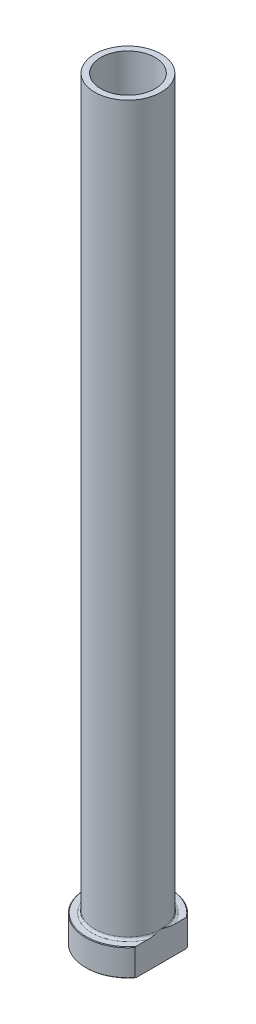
ISO-10303-21;
HEADER;
FILE_DESCRIPTION(('STEP AP214'),'2;1');
FILE_NAME('part.step','',(''),(''),'','','');
FILE_SCHEMA(('AUTOMOTIVE_DESIGN { 1 0 10303 214 1 1 1 1 }'));
ENDSEC;
DATA;
#1=APPLICATION_CONTEXT('core data for automotive mechanical design processes');
#2=APPLICATION_PROTOCOL_DEFINITION('international standard','automotive_design',2000,#1);
#3=PRODUCT_CONTEXT('',#1,'mechanical');
#4=PRODUCT('Part','Part','',(#3));
#5=PRODUCT_RELATED_PRODUCT_CATEGORY('part','',(#4));
#6=PRODUCT_DEFINITION_FORMATION('','',#4);
#7=PRODUCT_DEFINITION_CONTEXT('part definition',#1,'design');
#8=PRODUCT_DEFINITION('design','',#6,#7);
#9=PRODUCT_DEFINITION_SHAPE('','',#8);
#10=(LENGTH_UNIT() NAMED_UNIT(*) SI_UNIT(.MILLI.,.METRE.));
#11=(NAMED_UNIT(*) PLANE_ANGLE_UNIT() SI_UNIT($,.RADIAN.));
#12=(NAMED_UNIT(*) SI_UNIT($,.STERADIAN.) SOLID_ANGLE_UNIT());
#13=UNCERTAINTY_MEASURE_WITH_UNIT(LENGTH_MEASURE(1.E-05),#10,'distance_accuracy_value','');
#14=(GEOMETRIC_REPRESENTATION_CONTEXT(3) GLOBAL_UNCERTAINTY_ASSIGNED_CONTEXT((#13)) GLOBAL_UNIT_ASSIGNED_CONTEXT((#10,
#11,#12)) REPRESENTATION_CONTEXT('',''));
#15=CARTESIAN_POINT('',(0.,0.,0.));
#16=DIRECTION('',(0.,0.,1.));
#17=DIRECTION('',(1.,0.,0.));
#18=AXIS2_PLACEMENT_3D('',#15,#16,#17);
#19=CARTESIAN_POINT('',(0.,92.1876809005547,0.));
#20=DIRECTION('',(0.,1.,0.));
#21=DIRECTION('',(0.,0.,1.));
#22=AXIS2_PLACEMENT_3D('',#19,#20,#21);
#23=CYLINDRICAL_SURFACE('',#22,9.00000000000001);
#24=CARTESIAN_POINT('',(0.,250.,0.));
#25=DIRECTION('',(0.,1.,0.));
#26=DIRECTION('',(0.,0.,1.));
#27=AXIS2_PLACEMENT_3D('',#24,#25,#26);
#28=CIRCLE('',#27,9.00000000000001);
#29=CARTESIAN_POINT('',(0.,250.,9.00000000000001));
#30=VERTEX_POINT('',#29);
#31=EDGE_CURVE('E167',#30,#30,#28,.T.);
#32=ORIENTED_EDGE('',*,*,#31,.T.);
#33=EDGE_LOOP('',(#32));
#34=FACE_BOUND('',#33,.T.);
#35=CARTESIAN_POINT('',(0.,195.,0.));
#36=DIRECTION('',(0.,1.,0.));
#37=DIRECTION('',(0.,0.,1.));
#38=AXIS2_PLACEMENT_3D('',#35,#36,#37);
#39=CIRCLE('',#38,9.00000000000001);
#40=CARTESIAN_POINT('',(0.,195.,9.00000000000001));
#41=VERTEX_POINT('',#40);
#42=EDGE_CURVE('E170',#41,#41,#39,.T.);
#43=ORIENTED_EDGE('',*,*,#42,.F.);
#44=EDGE_LOOP('',(#43));
#45=FACE_BOUND('',#44,.T.);
#46=ADVANCED_FACE('F32',(#34,#45),#23,.F.);
#47=CARTESIAN_POINT('',(-9.00000000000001,250.,0.));
#48=DIRECTION('',(0.,1.,0.));
#49=DIRECTION('',(0.,0.,1.));
#50=AXIS2_PLACEMENT_3D('',#47,#48,#49);
#51=PLANE('',#50);
#52=CARTESIAN_POINT('',(0.,250.,0.));
#53=DIRECTION('',(0.,1.,0.));
#54=DIRECTION('',(0.,0.,1.));
#55=AXIS2_PLACEMENT_3D('',#52,#53,#54);
#56=CIRCLE('',#55,11.);
#57=CARTESIAN_POINT('',(0.,250.,11.));
#58=VERTEX_POINT('',#57);
#59=EDGE_CURVE('E174',#58,#58,#56,.T.);
#60=ORIENTED_EDGE('',*,*,#59,.T.);
#61=EDGE_LOOP('',(#60));
#62=FACE_BOUND('',#61,.T.);
#63=ORIENTED_EDGE('',*,*,#31,.F.);
#64=EDGE_LOOP('',(#63));
#65=FACE_BOUND('',#64,.T.);
#66=ADVANCED_FACE('F157',(#62,#65),#51,.T.);
#67=CARTESIAN_POINT('',(0.,92.1876809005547,0.));
#68=DIRECTION('',(0.,1.,0.));
#69=DIRECTION('',(0.,0.,1.));
#70=AXIS2_PLACEMENT_3D('',#67,#68,#69);
#71=CYLINDRICAL_SURFACE('',#70,11.);
#72=CARTESIAN_POINT('',(0.,9.8,0.));
#73=DIRECTION('',(0.,1.,0.));
#74=DIRECTION('',(0.,0.,1.));
#75=AXIS2_PLACEMENT_3D('',#72,#73,#74);
#76=CIRCLE('',#75,11.);
#77=CARTESIAN_POINT('',(11.,9.8,0.));
#78=VERTEX_POINT('',#77);
#79=EDGE_CURVE('E180',#78,#78,#76,.T.);
#80=ORIENTED_EDGE('',*,*,#79,.T.);
#81=EDGE_LOOP('',(#80));
#82=FACE_BOUND('',#81,.T.);
#83=ORIENTED_EDGE('',*,*,#59,.F.);
#84=EDGE_LOOP('',(#83));
#85=FACE_BOUND('',#84,.T.);
#86=ADVANCED_FACE('F162',(#82,#85),#71,.T.);
#87=CARTESIAN_POINT('',(-11.,9.,0.));
#88=DIRECTION('',(0.,1.,0.));
#89=DIRECTION('',(0.,0.,1.));
#90=AXIS2_PLACEMENT_3D('',#87,#88,#89);
#91=PLANE('',#90);
#92=DIRECTION('',(0.,0.,1.));
#93=VECTOR('',#92,1.);
#94=CARTESIAN_POINT('',(11.,9.,0.));
#95=LINE('',#94,#93);
#96=CARTESIAN_POINT('',(11.,9.,-8.33306666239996));
#97=VERTEX_POINT('',#96);
#98=CARTESIAN_POINT('',(11.,9.,-4.27083130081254));
#99=VERTEX_POINT('',#98);
#100=EDGE_CURVE('E54',#97,#99,#95,.T.);
#101=ORIENTED_EDGE('',*,*,#100,.F.);
#102=CARTESIAN_POINT('',(0.,9.,0.));
#103=DIRECTION('',(0.,1.,0.));
#104=DIRECTION('',(0.,0.,1.));
#105=AXIS2_PLACEMENT_3D('',#102,#103,#104);
#106=CIRCLE('',#105,13.8000000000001);
#107=CARTESIAN_POINT('',(11.,9.,8.33306666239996));
#108=VERTEX_POINT('',#107);
#109=EDGE_CURVE('E186',#97,#108,#106,.T.);
#110=ORIENTED_EDGE('',*,*,#109,.T.);
#111=CARTESIAN_POINT('',(11.,9.,4.27083130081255));
#112=VERTEX_POINT('',#111);
#113=EDGE_CURVE('E134',#112,#108,#95,.T.);
#114=ORIENTED_EDGE('',*,*,#113,.F.);
#115=CARTESIAN_POINT('',(0.,9.,0.));
#116=DIRECTION('',(0.,1.,0.));
#117=DIRECTION('',(0.,0.,1.));
#118=AXIS2_PLACEMENT_3D('',#115,#116,#117);
#119=CIRCLE('',#118,11.8);
#120=EDGE_CURVE('E183',#112,#99,#119,.F.);
#121=ORIENTED_EDGE('',*,*,#120,.T.);
#122=EDGE_LOOP('',(#101,#110,#114,#121));
#123=FACE_BOUND('',#122,.T.);
#124=ADVANCED_FACE('F197',(#123),#91,.T.);
#125=CARTESIAN_POINT('',(0.,92.1876809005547,0.));
#126=DIRECTION('',(0.,1.,0.));
#127=DIRECTION('',(0.,0.,1.));
#128=AXIS2_PLACEMENT_3D('',#125,#126,#127);
#129=CYLINDRICAL_SURFACE('',#128,14.);
#130=DIRECTION('',(0.,-1.,0.));
#131=VECTOR('',#130,1.);
#132=CARTESIAN_POINT('',(11.,250.,8.66025403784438));
#133=LINE('',#132,#131);
#134=CARTESIAN_POINT('',(11.,8.80000000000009,8.66025403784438));
#135=VERTEX_POINT('',#134);
#136=CARTESIAN_POINT('',(11.,0.200000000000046,8.66025403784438));
#137=VERTEX_POINT('',#136);
#138=EDGE_CURVE('E82',#135,#137,#133,.T.);
#139=ORIENTED_EDGE('',*,*,#138,.F.);
#140=CARTESIAN_POINT('',(0.,8.80000000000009,0.));
#141=DIRECTION('',(0.,1.,0.));
#142=DIRECTION('',(0.,0.,1.));
#143=AXIS2_PLACEMENT_3D('',#140,#141,#142);
#144=CIRCLE('',#143,14.);
#145=CARTESIAN_POINT('',(11.,8.80000000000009,-8.66025403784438));
#146=VERTEX_POINT('',#145);
#147=EDGE_CURVE('E95',#135,#146,#144,.F.);
#148=ORIENTED_EDGE('',*,*,#147,.T.);
#149=DIRECTION('',(0.,-1.,0.));
#150=VECTOR('',#149,1.);
#151=CARTESIAN_POINT('',(11.,250.,-8.66025403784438));
#152=LINE('',#151,#150);
#153=CARTESIAN_POINT('',(11.,0.200000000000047,-8.66025403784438));
#154=VERTEX_POINT('',#153);
#155=EDGE_CURVE('E192',#146,#154,#152,.T.);
#156=ORIENTED_EDGE('',*,*,#155,.T.);
#157=CARTESIAN_POINT('',(0.,0.200000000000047,0.));
#158=DIRECTION('',(0.,-1.,0.));
#159=DIRECTION('',(0.,0.,-1.));
#160=AXIS2_PLACEMENT_3D('',#157,#158,#159);
#161=CIRCLE('',#160,14.);
#162=EDGE_CURVE('E98',#154,#137,#161,.F.);
#163=ORIENTED_EDGE('',*,*,#162,.T.);
#164=EDGE_LOOP('',(#139,#148,#156,#163));
#165=FACE_BOUND('',#164,.T.);
#166=ADVANCED_FACE('F190',(#165),#129,.T.);
#167=CARTESIAN_POINT('',(-14.,0.,0.));
#168=DIRECTION('',(0.,-1.,0.));
#169=DIRECTION('',(0.,0.,-1.));
#170=AXIS2_PLACEMENT_3D('',#167,#168,#169);
#171=PLANE('',#170);
#172=CARTESIAN_POINT('',(0.,0.,0.));
#173=DIRECTION('',(0.,-1.,0.));
#174=DIRECTION('',(0.,0.,-1.));
#175=AXIS2_PLACEMENT_3D('',#172,#173,#174);
#176=CIRCLE('',#175,9.75000000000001);
#177=CARTESIAN_POINT('',(0.,0.,-9.75000000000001));
#178=VERTEX_POINT('',#177);
#179=EDGE_CURVE('E40',#178,#178,#176,.F.);
#180=ORIENTED_EDGE('',*,*,#179,.T.);
#181=EDGE_LOOP('',(#180));
#182=FACE_BOUND('',#181,.T.);
#183=DIRECTION('',(0.,0.,-1.));
#184=VECTOR('',#183,1.);
#185=CARTESIAN_POINT('',(11.,0.,8.66025403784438));
#186=LINE('',#185,#184);
#187=CARTESIAN_POINT('',(11.,0.,8.33306666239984));
#188=VERTEX_POINT('',#187);
#189=CARTESIAN_POINT('',(11.,0.,-8.33306666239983));
#190=VERTEX_POINT('',#189);
#191=EDGE_CURVE('E47',#188,#190,#186,.T.);
#192=ORIENTED_EDGE('',*,*,#191,.F.);
#193=CARTESIAN_POINT('',(0.,0.,0.));
#194=DIRECTION('',(0.,-1.,0.));
#195=DIRECTION('',(0.,0.,-1.));
#196=AXIS2_PLACEMENT_3D('',#193,#194,#195);
#197=CIRCLE('',#196,13.8);
#198=EDGE_CURVE('E92',#188,#190,#197,.T.);
#199=ORIENTED_EDGE('',*,*,#198,.T.);
#200=EDGE_LOOP('',(#192,#199));
#201=FACE_BOUND('',#200,.T.);
#202=ADVANCED_FACE('F91',(#182,#201),#171,.T.);
#203=CARTESIAN_POINT('',(0.,92.1876809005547,0.));
#204=DIRECTION('',(0.,1.,0.));
#205=DIRECTION('',(0.,0.,1.));
#206=AXIS2_PLACEMENT_3D('',#203,#204,#205);
#207=CYLINDRICAL_SURFACE('',#206,9.25);
#208=CARTESIAN_POINT('',(0.,0.5,0.));
#209=DIRECTION('',(0.,-1.,0.));
#210=DIRECTION('',(0.,0.,-1.));
#211=AXIS2_PLACEMENT_3D('',#208,#209,#210);
#212=CIRCLE('',#211,9.25);
#213=CARTESIAN_POINT('',(0.,0.5,-9.25));
#214=VERTEX_POINT('',#213);
#215=EDGE_CURVE('E11',#214,#214,#212,.T.);
#216=ORIENTED_EDGE('',*,*,#215,.T.);
#217=EDGE_LOOP('',(#216));
#218=FACE_BOUND('',#217,.T.);
#219=CARTESIAN_POINT('',(0.,183.,0.));
#220=DIRECTION('',(0.,1.,0.));
#221=DIRECTION('',(0.,0.,1.));
#222=AXIS2_PLACEMENT_3D('',#219,#220,#221);
#223=CIRCLE('',#222,9.25000000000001);
#224=CARTESIAN_POINT('',(0.,183.,9.25000000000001));
#225=VERTEX_POINT('',#224);
#226=EDGE_CURVE('E172',#225,#225,#223,.T.);
#227=ORIENTED_EDGE('',*,*,#226,.T.);
#228=EDGE_LOOP('',(#227));
#229=FACE_BOUND('',#228,.T.);
#230=ADVANCED_FACE('F215',(#218,#229),#207,.F.);
#231=CARTESIAN_POINT('',(0.,183.,0.));
#232=DIRECTION('',(0.,-1.,0.));
#233=DIRECTION('',(0.,0.,-1.));
#234=AXIS2_PLACEMENT_3D('',#231,#232,#233);
#235=CONICAL_SURFACE('',#234,9.25000000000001,0.0208303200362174);
#236=ORIENTED_EDGE('',*,*,#42,.T.);
#237=EDGE_LOOP('',(#236));
#238=FACE_BOUND('',#237,.T.);
#239=ORIENTED_EDGE('',*,*,#226,.F.);
#240=EDGE_LOOP('',(#239));
#241=FACE_BOUND('',#240,.T.);
#242=ADVANCED_FACE('F111',(#238,#241),#235,.F.);
#243=CARTESIAN_POINT('',(0.,9.8,0.));
#244=DIRECTION('',(0.,1.,0.));
#245=DIRECTION('',(0.,0.,1.));
#246=AXIS2_PLACEMENT_3D('',#243,#244,#245);
#247=TOROIDAL_SURFACE('',#246,11.8,0.8);
#248=ORIENTED_EDGE('',*,*,#120,.F.);
#249=CARTESIAN_POINT('',(11.,9.8,0.));
#250=CARTESIAN_POINT('',(11.,9.80000101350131,-1.16902346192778E-10));
#251=CARTESIAN_POINT('',(11.,9.80000202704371,3.62636704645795E-07));
#252=CARTESIAN_POINT('',(11.,9.80000392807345,1.38767058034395E-06));
#253=CARTESIAN_POINT('',(11.,9.80000479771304,2.07263794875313E-06));
#254=CARTESIAN_POINT('',(11.,9.80000659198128,3.71036705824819E-06));
#255=CARTESIAN_POINT('',(11.,9.80000749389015,4.68930249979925E-06));
#256=CARTESIAN_POINT('',(11.,9.80000912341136,6.73011617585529E-06));
#257=CARTESIAN_POINT('',(11.,9.80000985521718,7.78888191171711E-06));
#258=CARTESIAN_POINT('',(11.,9.80001253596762,1.18457661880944E-05));
#259=CARTESIAN_POINT('',(11.,9.80001433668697,1.49465078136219E-05));
#260=CARTESIAN_POINT('',(11.,9.80001733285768,2.11226767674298E-05));
#261=CARTESIAN_POINT('',(11.,9.80001856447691,2.41813368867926E-05));
#262=CARTESIAN_POINT('',(11.,9.80002366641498,3.7001376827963E-05));
#263=CARTESIAN_POINT('',(11.,9.80002742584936,4.68141732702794E-05));
#264=CARTESIAN_POINT('',(11.,9.80003302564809,6.54425693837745E-05));
#265=CARTESIAN_POINT('',(11.,9.80003506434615,7.41984112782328E-05));
#266=CARTESIAN_POINT('',(11.,9.80004981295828,0.000138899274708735));
#267=CARTESIAN_POINT('',(11.,9.80006088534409,0.000195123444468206));
#268=CARTESIAN_POINT('',(11.,9.80010935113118,0.000417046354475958));
#269=CARTESIAN_POINT('',(11.,9.80015570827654,0.00058074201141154));
#270=CARTESIAN_POINT('',(11.,9.80033600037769,0.00122860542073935));
#271=CARTESIAN_POINT('',(11.,9.80046404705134,0.00171390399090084));
#272=CARTESIAN_POINT('',(11.,9.80097655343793,0.00364143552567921));
#273=CARTESIAN_POINT('',(11.,9.80136837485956,0.0050822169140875));
#274=CARTESIAN_POINT('',(11.,9.80300002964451,0.0110983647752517));
#275=CARTESIAN_POINT('',(11.,9.80423069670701,0.0156755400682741));
#276=CARTESIAN_POINT('',(10.9999999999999,9.82474721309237,0.0919599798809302));
#277=CARTESIAN_POINT('',(11.,9.84411511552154,0.163651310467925));
#278=CARTESIAN_POINT('',(11.,9.88193435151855,0.30414468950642));
#279=CARTESIAN_POINT('',(11.,9.90039088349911,0.37294547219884));
#280=CARTESIAN_POINT('',(11.,9.93953155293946,0.519420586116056));
#281=CARTESIAN_POINT('',(11.,9.96019740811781,0.597099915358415));
#282=CARTESIAN_POINT('',(11.,10.0014716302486,0.753402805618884));
#283=CARTESIAN_POINT('',(11.,10.0220767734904,0.832027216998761));
#284=CARTESIAN_POINT('',(11.,10.0569012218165,0.966276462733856));
#285=CARTESIAN_POINT('',(11.,10.0712190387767,1.02187571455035));
#286=CARTESIAN_POINT('',(11.,10.0995828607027,1.13298938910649));
#287=CARTESIAN_POINT('',(11.,10.1136294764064,1.18850365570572));
#288=CARTESIAN_POINT('',(11.,10.1546367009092,1.35225812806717));
#289=CARTESIAN_POINT('',(11.,10.1812165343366,1.46059357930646));
#290=CARTESIAN_POINT('',(11.,10.266911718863,1.81933910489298));
#291=CARTESIAN_POINT('',(11.,10.3231642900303,2.07044657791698));
#292=CARTESIAN_POINT('',(11.,10.4250125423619,2.57779828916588));
#293=CARTESIAN_POINT('',(11.,10.4704839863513,2.83406864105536));
#294=CARTESIAN_POINT('',(11.,10.5272211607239,3.230962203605));
#295=CARTESIAN_POINT('',(11.,10.5446090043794,3.37070252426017));
#296=CARTESIAN_POINT('',(11.,10.5730475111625,3.65081430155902));
#297=CARTESIAN_POINT('',(11.,10.5840998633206,3.79118557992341));
#298=CARTESIAN_POINT('',(11.,10.5982304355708,4.07161741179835));
#299=CARTESIAN_POINT('',(11.,10.6013499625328,4.21167576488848));
#300=CARTESIAN_POINT('',(11.,10.5975625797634,4.49161919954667));
#301=CARTESIAN_POINT('',(11.,10.5906655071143,4.63150431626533));
#302=CARTESIAN_POINT('',(11.,10.5704363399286,4.83931097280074));
#303=CARTESIAN_POINT('',(11.,10.562146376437,4.90772588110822));
#304=CARTESIAN_POINT('',(11.,10.5417448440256,5.0440552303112));
#305=CARTESIAN_POINT('',(11.,10.5296301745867,5.11196921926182));
#306=CARTESIAN_POINT('',(11.,10.5009997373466,5.24610291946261));
#307=CARTESIAN_POINT('',(11.,10.4845340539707,5.3123330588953));
#308=CARTESIAN_POINT('',(11.,10.4461783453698,5.44314716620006));
#309=CARTESIAN_POINT('',(11.,10.4242944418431,5.50773290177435));
#310=CARTESIAN_POINT('',(11.,10.373421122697,5.63494480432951));
#311=CARTESIAN_POINT('',(11.,10.3443615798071,5.69754429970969));
#312=CARTESIAN_POINT('',(11.,10.2940125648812,5.78758577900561));
#313=CARTESIAN_POINT('',(11.,10.2761248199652,5.8169284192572));
#314=CARTESIAN_POINT('',(11.,10.2377448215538,5.87384301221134));
#315=CARTESIAN_POINT('',(11.,10.217255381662,5.90141683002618));
#316=CARTESIAN_POINT('',(11.,10.1754926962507,5.95144540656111));
#317=CARTESIAN_POINT('',(11.,10.154505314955,5.97413611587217));
#318=CARTESIAN_POINT('',(11.,10.1098178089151,6.01675330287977));
#319=CARTESIAN_POINT('',(11.,10.0861159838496,6.03667803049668));
#320=CARTESIAN_POINT('',(11.,10.0355211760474,6.07288913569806));
#321=CARTESIAN_POINT('',(11.,10.0085887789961,6.0891216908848));
#322=CARTESIAN_POINT('',(11.,9.95208821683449,6.11604527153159));
#323=CARTESIAN_POINT('',(11.,9.92252876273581,6.12675386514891));
#324=CARTESIAN_POINT('',(11.,9.87044933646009,6.13915978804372));
#325=CARTESIAN_POINT('',(11.,9.84833164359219,6.14255775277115));
#326=CARTESIAN_POINT('',(11.,9.80383923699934,6.1455308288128));
#327=CARTESIAN_POINT('',(11.,9.78146463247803,6.14510750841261));
#328=CARTESIAN_POINT('',(11.,9.73715415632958,6.14047859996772));
#329=CARTESIAN_POINT('',(11.,9.71521765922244,6.13627886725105));
#330=CARTESIAN_POINT('',(11.,9.67228934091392,6.12446633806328));
#331=CARTESIAN_POINT('',(11.,9.6512982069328,6.11685110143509));
#332=CARTESIAN_POINT('',(11.,9.60293880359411,6.09531376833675));
#333=CARTESIAN_POINT('',(11.,9.57614979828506,6.08009633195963));
#334=CARTESIAN_POINT('',(11.,9.52533680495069,6.0455920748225));
#335=CARTESIAN_POINT('',(11.,9.50131971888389,6.02629542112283));
#336=CARTESIAN_POINT('',(11.,9.44252607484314,5.97248581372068));
#337=CARTESIAN_POINT('',(11.,9.40981527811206,5.93573547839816));
#338=CARTESIAN_POINT('',(11.,9.35019076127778,5.85789950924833));
#339=CARTESIAN_POINT('',(11.,9.32328591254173,5.81680738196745));
#340=CARTESIAN_POINT('',(11.,9.27531247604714,5.73382009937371));
#341=CARTESIAN_POINT('',(11.,9.25403723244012,5.69204233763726));
#342=CARTESIAN_POINT('',(11.,9.21507165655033,5.60682590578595));
#343=CARTESIAN_POINT('',(11.,9.19738479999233,5.56338567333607));
#344=CARTESIAN_POINT('',(11.,9.16492416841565,5.47505507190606));
#345=CARTESIAN_POINT('',(11.,9.15017444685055,5.43015597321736));
#346=CARTESIAN_POINT('',(11.,9.12332484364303,5.33960740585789));
#347=CARTESIAN_POINT('',(11.,9.1112236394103,5.29395832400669));
#348=CARTESIAN_POINT('',(11.,9.08512909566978,5.18461425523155));
#349=CARTESIAN_POINT('',(11.,9.07217244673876,5.1206724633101));
#350=CARTESIAN_POINT('',(11.,9.04991113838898,4.99214785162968));
#351=CARTESIAN_POINT('',(11.,9.0406080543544,4.92756476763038));
#352=CARTESIAN_POINT('',(11.,9.01731839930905,4.73294213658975));
#353=CARTESIAN_POINT('',(11.,9.00801869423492,4.60233754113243));
#354=CARTESIAN_POINT('',(11.,8.99902947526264,4.3455019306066));
#355=CARTESIAN_POINT('',(11.,8.99901276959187,4.21927902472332));
#356=CARTESIAN_POINT('',(11.,9.00595929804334,3.96771196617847));
#357=CARTESIAN_POINT('',(11.,9.01288556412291,3.84236670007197));
#358=CARTESIAN_POINT('',(11.,9.03307410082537,3.58284783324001));
#359=CARTESIAN_POINT('',(11.,9.0467683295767,3.44870920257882));
#360=CARTESIAN_POINT('',(11.,9.07939011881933,3.18114709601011));
#361=CARTESIAN_POINT('',(11.,9.09831526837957,3.04772331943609));
#362=CARTESIAN_POINT('',(11.,9.14092023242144,2.77842123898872));
#363=CARTESIAN_POINT('',(11.,9.16470161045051,2.64255921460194));
#364=CARTESIAN_POINT('',(11.,9.21593088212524,2.3711650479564));
#365=CARTESIAN_POINT('',(11.,9.2433882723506,2.23563471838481));
#366=CARTESIAN_POINT('',(11.,9.31183649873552,1.91532204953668));
#367=CARTESIAN_POINT('',(11.,9.35408384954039,1.73080986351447));
#368=CARTESIAN_POINT('',(11.,9.44184141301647,1.3647744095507));
#369=CARTESIAN_POINT('',(11.,9.48730948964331,1.18324089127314));
#370=CARTESIAN_POINT('',(11.,9.55452451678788,0.921934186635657));
#371=CARTESIAN_POINT('',(11.,9.57534575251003,0.841920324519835));
#372=CARTESIAN_POINT('',(11.,9.61742284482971,0.681633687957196));
#373=CARTESIAN_POINT('',(11.,9.63868020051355,0.601361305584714));
#374=CARTESIAN_POINT('',(11.,9.68246779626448,0.436916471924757));
#375=CARTESIAN_POINT('',(11.,9.70500908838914,0.352747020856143));
#376=CARTESIAN_POINT('',(11.,9.74991333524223,0.18580922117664));
#377=CARTESIAN_POINT('',(10.9999999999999,9.77227331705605,0.103040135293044));
#378=CARTESIAN_POINT('',(11.,9.79577053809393,0.0156708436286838));
#379=CARTESIAN_POINT('',(11.,9.7970024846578,0.0110889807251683));
#380=CARTESIAN_POINT('',(11.,9.7986344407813,0.00507176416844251));
#381=CARTESIAN_POINT('',(11.,9.79902527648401,0.00363459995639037));
#382=CARTESIAN_POINT('',(11.,9.79953658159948,0.00171158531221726));
#383=CARTESIAN_POINT('',(11.,9.7996643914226,0.00122718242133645));
#384=CARTESIAN_POINT('',(11.,9.79984439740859,0.000580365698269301));
#385=CARTESIAN_POINT('',(11.,9.79989071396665,0.000416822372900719));
#386=CARTESIAN_POINT('',(11.,9.79993914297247,0.000195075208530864));
#387=CARTESIAN_POINT('',(11.,9.79995021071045,0.000138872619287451));
#388=CARTESIAN_POINT('',(11.,9.79996494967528,7.4193723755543E-05));
#389=CARTESIAN_POINT('',(11.,9.7999669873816,6.54391003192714E-05));
#390=CARTESIAN_POINT('',(11.,9.79997258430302,4.68131850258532E-05));
#391=CARTESIAN_POINT('',(11.,9.79997634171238,3.70015863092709E-05));
#392=CARTESIAN_POINT('',(11.,9.79998144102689,2.41827824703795E-05));
#393=CARTESIAN_POINT('',(11.,9.79998267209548,2.11242135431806E-05));
#394=CARTESIAN_POINT('',(11.,9.79998566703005,1.49481346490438E-05));
#395=CARTESIAN_POINT('',(11.,9.79998746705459,1.18473808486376E-05));
#396=CARTESIAN_POINT('',(11.,9.79999014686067,7.79037229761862E-06));
#397=CARTESIAN_POINT('',(11.,9.79999087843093,6.73154442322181E-06));
#398=CARTESIAN_POINT('',(11.,9.79999250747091,4.69056395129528E-06));
#399=CARTESIAN_POINT('',(11.,9.79999340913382,3.71152244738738E-06));
#400=CARTESIAN_POINT('',(11.,9.79999520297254,2.07354325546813E-06));
#401=CARTESIAN_POINT('',(11.,9.79999607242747,1.38844094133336E-06));
#402=CARTESIAN_POINT('',(11.,9.79999797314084,3.63067665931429E-07));
#403=CARTESIAN_POINT('',(11.,9.79999898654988,1.16900849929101E-10));
#404=CARTESIAN_POINT('',(11.,9.8,0.));
#405=B_SPLINE_CURVE_WITH_KNOTS('',3,(#249,#250,#251,#252,#253,#254,#255,#256,#257,#258,#259,
#260,#261,#262,#263,#264,#265,#266,#267,#268,#269,#270,#271,#272,#273,#274,#275,#276,#277,#278,
#279,#280,#281,#282,#283,#284,#285,#286,#287,#288,#289,#290,#291,#292,#293,#294,#295,#296,#297,
#298,#299,#300,#301,#302,#303,#304,#305,#306,#307,#308,#309,#310,#311,#312,#313,#314,#315,#316,
#317,#318,#319,#320,#321,#322,#323,#324,#325,#326,#327,#328,#329,#330,#331,#332,#333,#334,#335,
#336,#337,#338,#339,#340,#341,#342,#343,#344,#345,#346,#347,#348,#349,#350,#351,#352,#353,#354,
#355,#356,#357,#358,#359,#360,#361,#362,#363,#364,#365,#366,#367,#368,#369,#370,#371,#372,#373,
#374,#375,#376,#377,#378,#379,#380,#381,#382,#383,#384,#385,#386,#387,#388,#389,#390,#391,#392,
#393,#394,#395,#396,#397,#398,#399,#400,#401,#402,#403,#404),.UNSPECIFIED.,.T.,.F.,(4,2,2,2,2,2,
2,2,2,2,2,2,2,2,2,2,2,2,2,2,2,2,2,2,2,2,2,2,2,2,2,2,2,2,2,2,2,2,2,2,2,2,2,2,2,2,2,2,2,2,2,2,2,2,
2,2,2,2,2,2,2,2,2,2,2,2,2,2,2,2,2,2,2,2,2,2,2,4),(0.,3.0607599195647E-06,6.37973333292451E-06,
1.03502641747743E-05,1.42089691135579E-05,2.49252519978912E-05,3.4808549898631E-05,
6.62739339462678E-05,9.32104374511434E-05,0.000265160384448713,0.000775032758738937,
0.00228129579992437,0.00675996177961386,0.0209798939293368,0.243756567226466,0.457458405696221,
0.698601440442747,0.942439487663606,1.11467870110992,1.28646938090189,1.62111125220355,
2.39296447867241,3.17332138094,3.595666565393,4.0178991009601,4.43792849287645,4.85754566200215,
5.06420795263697,5.27103820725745,5.47558418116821,5.67990009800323,5.88629782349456,
5.98928489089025,6.0921615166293,6.18469603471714,6.27728883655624,6.3711554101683,
6.46472158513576,6.53154940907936,6.59834980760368,6.66504681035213,6.73179153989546,
6.82369899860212,6.91583057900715,7.06259901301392,7.20959014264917,7.3500307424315,
7.4906067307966,7.63229046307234,7.77390328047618,7.9694893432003,8.16515964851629,
8.55744262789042,8.93589815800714,9.31234923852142,9.71673016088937,10.1209250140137,
10.5346477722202,10.9494607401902,11.5172595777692,12.0786596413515,12.3266950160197,
12.575811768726,12.8372206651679,13.094420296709,13.1086548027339,13.1131222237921,
13.1146257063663,13.1151351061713,13.1153069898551,13.1153339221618,13.1153653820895,
13.1153752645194,13.1153859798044,13.1153898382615,13.115393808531,13.1153971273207,
13.115400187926),.UNSPECIFIED.);
#406=EDGE_CURVE('E126',#112,#78,#405,.T.);
#407=ORIENTED_EDGE('',*,*,#406,.T.);
#408=ORIENTED_EDGE('',*,*,#79,.F.);
#409=CARTESIAN_POINT('',(11.,9.8,0.));
#410=CARTESIAN_POINT('',(11.,9.7999989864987,1.16907186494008E-10));
#411=CARTESIAN_POINT('',(11.,9.7999979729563,-3.62636699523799E-07));
#412=CARTESIAN_POINT('',(11.,9.79999607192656,-1.38767057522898E-06));
#413=CARTESIAN_POINT('',(11.,9.79999520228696,-2.07263794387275E-06));
#414=CARTESIAN_POINT('',(11.,9.79999340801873,-3.71036705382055E-06));
#415=CARTESIAN_POINT('',(11.,9.79999250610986,-4.68930249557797E-06));
#416=CARTESIAN_POINT('',(11.,9.79999087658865,-6.73011617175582E-06));
#417=CARTESIAN_POINT('',(11.,9.79999014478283,-7.78888190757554E-06));
#418=CARTESIAN_POINT('',(11.,9.79998746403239,-1.18457661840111E-05));
#419=CARTESIAN_POINT('',(11.,9.79998566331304,-1.49465078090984E-05));
#420=CARTESIAN_POINT('',(11.,9.79998266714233,-2.11226767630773E-05));
#421=CARTESIAN_POINT('',(11.,9.79998143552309,-2.41813368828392E-05));
#422=CARTESIAN_POINT('',(11.,9.79997633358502,-3.70013768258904E-05));
#423=CARTESIAN_POINT('',(11.,9.79997257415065,-4.68141732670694E-05));
#424=CARTESIAN_POINT('',(11.,9.79996697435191,-6.54425693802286E-05));
#425=CARTESIAN_POINT('',(11.,9.79996493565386,-7.41984112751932E-05));
#426=CARTESIAN_POINT('',(11.,9.79995018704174,-0.00013889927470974));
#427=CARTESIAN_POINT('',(11.,9.79993911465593,-0.000195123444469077));
#428=CARTESIAN_POINT('',(11.,9.79989064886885,-0.000417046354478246));
#429=CARTESIAN_POINT('',(11.,9.7998442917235,-0.000580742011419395));
#430=CARTESIAN_POINT('',(11.,9.79966399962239,-0.00122860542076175));
#431=CARTESIAN_POINT('',(11.,9.79953595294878,-0.00171390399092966));
#432=CARTESIAN_POINT('',(11.,9.79902344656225,-0.00364143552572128));
#433=CARTESIAN_POINT('',(11.,9.79863162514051,-0.00508221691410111));
#434=CARTESIAN_POINT('',(11.,9.79699997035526,-0.0110983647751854));
#435=CARTESIAN_POINT('',(11.,9.79576930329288,-0.0156755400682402));
#436=CARTESIAN_POINT('',(10.9999999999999,9.77525278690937,-0.0919599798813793));
#437=CARTESIAN_POINT('',(11.,9.75588488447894,-0.163651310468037));
#438=CARTESIAN_POINT('',(11.,9.71806564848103,-0.3041446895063));
#439=CARTESIAN_POINT('',(11.,9.69960911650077,-0.372945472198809));
#440=CARTESIAN_POINT('',(11.,9.66046844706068,-0.519420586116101));
#441=CARTESIAN_POINT('',(11.,9.63980259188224,-0.597099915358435));
#442=CARTESIAN_POINT('',(11.,9.59852836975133,-0.753402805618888));
#443=CARTESIAN_POINT('',(11.,9.5779232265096,-0.832027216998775));
#444=CARTESIAN_POINT('',(11.,9.54309877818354,-0.966276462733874));
#445=CARTESIAN_POINT('',(11.,9.52878096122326,-1.02187571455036));
#446=CARTESIAN_POINT('',(11.,9.50041713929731,-1.1329893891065));
#447=CARTESIAN_POINT('',(11.,9.48637052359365,-1.18850365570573));
#448=CARTESIAN_POINT('',(11.,9.44536329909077,-1.35225812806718));
#449=CARTESIAN_POINT('',(11.,9.41878346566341,-1.46059357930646));
#450=CARTESIAN_POINT('',(11.,9.33308828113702,-1.81933910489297));
#451=CARTESIAN_POINT('',(11.,9.27683570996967,-2.07044657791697));
#452=CARTESIAN_POINT('',(11.,9.17498745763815,-2.57779828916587));
#453=CARTESIAN_POINT('',(11.,9.12951601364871,-2.83406864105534));
#454=CARTESIAN_POINT('',(11.,9.07277883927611,-3.23096220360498));
#455=CARTESIAN_POINT('',(11.,9.0553909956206,-3.37070252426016));
#456=CARTESIAN_POINT('',(11.,9.0269524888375,-3.65081430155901));
#457=CARTESIAN_POINT('',(11.,9.01590013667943,-3.7911855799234));
#458=CARTESIAN_POINT('',(11.,9.00176956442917,-4.07161741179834));
#459=CARTESIAN_POINT('',(11.,8.99865003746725,-4.21167576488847));
#460=CARTESIAN_POINT('',(11.,9.00243742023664,-4.49161919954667));
#461=CARTESIAN_POINT('',(11.,9.00933449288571,-4.63150431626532));
#462=CARTESIAN_POINT('',(11.,9.02956366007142,-4.83931097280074));
#463=CARTESIAN_POINT('',(11.,9.03785362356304,-4.90772588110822));
#464=CARTESIAN_POINT('',(11.,9.0582551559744,-5.04405523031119));
#465=CARTESIAN_POINT('',(11.,9.07036982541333,-5.11196921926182));
#466=CARTESIAN_POINT('',(11.,9.09900026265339,-5.24610291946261));
#467=CARTESIAN_POINT('',(11.,9.11546594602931,-5.31233305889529));
#468=CARTESIAN_POINT('',(11.,9.15382165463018,-5.44314716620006));
#469=CARTESIAN_POINT('',(11.,9.17570555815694,-5.50773290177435));
#470=CARTESIAN_POINT('',(11.,9.22657887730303,-5.6349448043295));
#471=CARTESIAN_POINT('',(11.,9.25563842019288,-5.69754429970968));
#472=CARTESIAN_POINT('',(11.,9.30598743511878,-5.7875857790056));
#473=CARTESIAN_POINT('',(11.,9.3238751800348,-5.81692841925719));
#474=CARTESIAN_POINT('',(11.,9.36225517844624,-5.87384301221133));
#475=CARTESIAN_POINT('',(11.,9.38274461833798,-5.90141683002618));
#476=CARTESIAN_POINT('',(11.,9.42450730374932,-5.9514454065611));
#477=CARTESIAN_POINT('',(11.,9.44549468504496,-5.97413611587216));
#478=CARTESIAN_POINT('',(11.,9.49018219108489,-6.01675330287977));
#479=CARTESIAN_POINT('',(11.,9.51388401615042,-6.03667803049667));
#480=CARTESIAN_POINT('',(11.,9.56447882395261,-6.07288913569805));
#481=CARTESIAN_POINT('',(11.,9.59141122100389,-6.0891216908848));
#482=CARTESIAN_POINT('',(11.,9.64791178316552,-6.11604527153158));
#483=CARTESIAN_POINT('',(11.,9.67747123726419,-6.1267538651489));
#484=CARTESIAN_POINT('',(11.,9.72955066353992,-6.13915978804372));
#485=CARTESIAN_POINT('',(11.,9.75166835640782,-6.14255775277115));
#486=CARTESIAN_POINT('',(11.,9.79616076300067,-6.1455308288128));
#487=CARTESIAN_POINT('',(11.,9.81853536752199,-6.1451075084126));
#488=CARTESIAN_POINT('',(11.,9.86284584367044,-6.14047859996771));
#489=CARTESIAN_POINT('',(11.,9.88478234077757,-6.13627886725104));
#490=CARTESIAN_POINT('',(11.,9.92771065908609,-6.12446633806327));
#491=CARTESIAN_POINT('',(11.,9.94870179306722,-6.11685110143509));
#492=CARTESIAN_POINT('',(11.,9.9970611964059,-6.09531376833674));
#493=CARTESIAN_POINT('',(11.,10.023850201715,-6.08009633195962));
#494=CARTESIAN_POINT('',(11.,10.0746631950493,-6.04559207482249));
#495=CARTESIAN_POINT('',(11.,10.0986802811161,-6.02629542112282));
#496=CARTESIAN_POINT('',(11.,10.1574739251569,-5.97248581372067));
#497=CARTESIAN_POINT('',(11.,10.1901847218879,-5.93573547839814));
#498=CARTESIAN_POINT('',(11.,10.2498092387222,-5.85789950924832));
#499=CARTESIAN_POINT('',(11.,10.2767140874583,-5.81680738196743));
#500=CARTESIAN_POINT('',(11.,10.3246875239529,-5.73382009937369));
#501=CARTESIAN_POINT('',(11.,10.3459627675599,-5.69204233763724));
#502=CARTESIAN_POINT('',(11.,10.3849283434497,-5.60682590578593));
#503=CARTESIAN_POINT('',(11.,10.4026152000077,-5.56338567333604));
#504=CARTESIAN_POINT('',(11.,10.4350758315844,-5.47505507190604));
#505=CARTESIAN_POINT('',(11.,10.4498255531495,-5.43015597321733));
#506=CARTESIAN_POINT('',(11.,10.476675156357,-5.33960740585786));
#507=CARTESIAN_POINT('',(11.,10.4887763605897,-5.29395832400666));
#508=CARTESIAN_POINT('',(11.,10.5148709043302,-5.18461425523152));
#509=CARTESIAN_POINT('',(11.,10.5278275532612,-5.12067246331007));
#510=CARTESIAN_POINT('',(11.,10.550088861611,-4.99214785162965));
#511=CARTESIAN_POINT('',(11.,10.5593919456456,-4.92756476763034));
#512=CARTESIAN_POINT('',(11.,10.582681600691,-4.73294213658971));
#513=CARTESIAN_POINT('',(11.,10.5919813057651,-4.60233754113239));
#514=CARTESIAN_POINT('',(11.,10.6009705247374,-4.34550193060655));
#515=CARTESIAN_POINT('',(11.,10.6009872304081,-4.21927902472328));
#516=CARTESIAN_POINT('',(11.,10.5940407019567,-3.96771196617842));
#517=CARTESIAN_POINT('',(11.,10.5871144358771,-3.84236670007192));
#518=CARTESIAN_POINT('',(11.,10.5669258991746,-3.58284783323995));
#519=CARTESIAN_POINT('',(11.,10.5532316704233,-3.44870920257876));
#520=CARTESIAN_POINT('',(11.,10.5206098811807,-3.18114709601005));
#521=CARTESIAN_POINT('',(11.,10.5016847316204,-3.04772331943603));
#522=CARTESIAN_POINT('',(11.,10.4590797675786,-2.77842123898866));
#523=CARTESIAN_POINT('',(11.,10.4352983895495,-2.64255921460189));
#524=CARTESIAN_POINT('',(11.,10.3840691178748,-2.37116504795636));
#525=CARTESIAN_POINT('',(11.,10.3566117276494,-2.23563471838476));
#526=CARTESIAN_POINT('',(11.,10.2881635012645,-1.91532204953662));
#527=CARTESIAN_POINT('',(11.,10.2459161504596,-1.7308098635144));
#528=CARTESIAN_POINT('',(11.,10.1581585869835,-1.36477440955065));
#529=CARTESIAN_POINT('',(11.,10.1126905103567,-1.18324089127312));
#530=CARTESIAN_POINT('',(11.,10.0454754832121,-0.921934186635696));
#531=CARTESIAN_POINT('',(11.,10.02465424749,-0.84192032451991));
#532=CARTESIAN_POINT('',(11.,9.98257715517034,-0.681633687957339));
#533=CARTESIAN_POINT('',(11.,9.96131979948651,-0.60136130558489));
#534=CARTESIAN_POINT('',(11.,9.91753220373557,-0.436916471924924));
#535=CARTESIAN_POINT('',(11.,9.89499091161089,-0.352747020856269));
#536=CARTESIAN_POINT('',(11.,9.85008666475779,-0.185809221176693));
#537=CARTESIAN_POINT('',(10.9999999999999,9.82772668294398,-0.103040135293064));
#538=CARTESIAN_POINT('',(11.,9.80422946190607,-0.0156708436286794));
#539=CARTESIAN_POINT('',(11.,9.80299751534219,-0.0110889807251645));
#540=CARTESIAN_POINT('',(11.,9.80136555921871,-0.0050717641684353));
#541=CARTESIAN_POINT('',(11.,9.800974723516,-0.00363459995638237));
#542=CARTESIAN_POINT('',(11.,9.80046341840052,-0.00171158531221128));
#543=CARTESIAN_POINT('',(11.,9.80033560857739,-0.0012271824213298));
#544=CARTESIAN_POINT('',(11.,9.80015560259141,-0.000580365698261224));
#545=CARTESIAN_POINT('',(11.,9.80010928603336,-0.000416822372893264));
#546=CARTESIAN_POINT('',(11.,9.80006085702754,-0.000195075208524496));
#547=CARTESIAN_POINT('',(11.,9.80004978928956,-0.000138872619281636));
#548=CARTESIAN_POINT('',(11.,9.80003505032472,-7.41937237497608E-05));
#549=CARTESIAN_POINT('',(11.,9.80003301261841,-6.54391003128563E-05));
#550=CARTESIAN_POINT('',(11.,9.80002741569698,-4.68131850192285E-05));
#551=CARTESIAN_POINT('',(11.,9.80002365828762,-3.70015863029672E-05));
#552=CARTESIAN_POINT('',(11.,9.80001855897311,-2.41827824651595E-05));
#553=CARTESIAN_POINT('',(11.,9.80001732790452,-2.11242135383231E-05));
#554=CARTESIAN_POINT('',(11.,9.80001433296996,-1.49481346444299E-05));
#555=CARTESIAN_POINT('',(11.,9.80001253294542,-1.18473808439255E-05));
#556=CARTESIAN_POINT('',(11.,9.80000985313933,-7.79037229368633E-06));
#557=CARTESIAN_POINT('',(11.,9.80000912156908,-6.7315444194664E-06));
#558=CARTESIAN_POINT('',(11.,9.80000749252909,-4.69056394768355E-06));
#559=CARTESIAN_POINT('',(11.,9.80000659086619,-3.71152244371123E-06));
#560=CARTESIAN_POINT('',(11.,9.80000479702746,-2.07354325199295E-06));
#561=CARTESIAN_POINT('',(11.,9.80000392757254,-1.38844093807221E-06));
#562=CARTESIAN_POINT('',(11.,9.80000202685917,-3.63067662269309E-07));
#563=CARTESIAN_POINT('',(11.,9.80000101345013,-1.16896876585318E-10));
#564=CARTESIAN_POINT('',(11.,9.8,0.));
#565=B_SPLINE_CURVE_WITH_KNOTS('',3,(#409,#410,#411,#412,#413,#414,#415,#416,#417,#418,#419,
#420,#421,#422,#423,#424,#425,#426,#427,#428,#429,#430,#431,#432,#433,#434,#435,#436,#437,#438,
#439,#440,#441,#442,#443,#444,#445,#446,#447,#448,#449,#450,#451,#452,#453,#454,#455,#456,#457,
#458,#459,#460,#461,#462,#463,#464,#465,#466,#467,#468,#469,#470,#471,#472,#473,#474,#475,#476,
#477,#478,#479,#480,#481,#482,#483,#484,#485,#486,#487,#488,#489,#490,#491,#492,#493,#494,#495,
#496,#497,#498,#499,#500,#501,#502,#503,#504,#505,#506,#507,#508,#509,#510,#511,#512,#513,#514,
#515,#516,#517,#518,#519,#520,#521,#522,#523,#524,#525,#526,#527,#528,#529,#530,#531,#532,#533,
#534,#535,#536,#537,#538,#539,#540,#541,#542,#543,#544,#545,#546,#547,#548,#549,#550,#551,#552,
#553,#554,#555,#556,#557,#558,#559,#560,#561,#562,#563,#564),.UNSPECIFIED.,.T.,.F.,(4,2,2,2,2,2,
2,2,2,2,2,2,2,2,2,2,2,2,2,2,2,2,2,2,2,2,2,2,2,2,2,2,2,2,2,2,2,2,2,2,2,2,2,2,2,2,2,2,2,2,2,2,2,2,
2,2,2,2,2,2,2,2,2,2,2,2,2,2,2,2,2,2,2,2,2,2,2,4),(0.,3.06075992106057E-06,6.37973333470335E-06,
1.03502641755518E-05,1.42089691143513E-05,2.492525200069E-05,3.48085499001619E-05,
6.6273933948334E-05,9.3210437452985E-05,0.000265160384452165,0.000775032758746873,
0.00228129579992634,0.00675996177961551,0.0209798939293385,0.243756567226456,0.457458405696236,
0.698601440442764,0.942439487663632,1.11467870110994,1.28646938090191,1.62111125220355,
2.39296447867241,3.17332138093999,3.595666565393,4.01789910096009,4.43792849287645,
4.85754566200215,5.06420795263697,5.27103820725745,5.47558418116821,5.67990009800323,
5.88629782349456,5.98928489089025,6.0921615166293,6.18469603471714,6.27728883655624,
6.37115541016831,6.46472158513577,6.53154940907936,6.59834980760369,6.66504681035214,
6.73179153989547,6.82369899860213,6.91583057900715,7.06259901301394,7.20959014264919,
7.35003074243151,7.49060673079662,7.63229046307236,7.7739032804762,7.96948934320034,
8.16515964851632,8.55744262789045,8.93589815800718,9.31234923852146,9.71673016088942,
10.1209250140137,10.5346477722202,10.9494607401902,11.5172595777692,12.0786596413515,
12.3266950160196,12.5758117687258,12.8372206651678,13.094420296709,13.1086548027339,
13.1131222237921,13.1146257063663,13.1151351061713,13.1153069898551,13.1153339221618,
13.1153653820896,13.1153752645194,13.1153859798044,13.1153898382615,13.115393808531,
13.1153971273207,13.115400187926),.UNSPECIFIED.);
#566=EDGE_CURVE('E135',#78,#99,#565,.T.);
#567=ORIENTED_EDGE('',*,*,#566,.T.);
#568=EDGE_LOOP('',(#248,#407,#408,#567));
#569=FACE_BOUND('',#568,.T.);
#570=ADVANCED_FACE('F141',(#569),#247,.F.);
#571=CARTESIAN_POINT('',(0.,8.99999999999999,0.));
#572=DIRECTION('',(0.,-1.,0.));
#573=DIRECTION('',(0.,0.,-1.));
#574=AXIS2_PLACEMENT_3D('',#571,#572,#573);
#575=CONICAL_SURFACE('',#574,13.8000000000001,0.785398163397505);
#576=CARTESIAN_POINT('',(11.,0.799226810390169,-19.0534516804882));
#577=CARTESIAN_POINT('',(11.,1.04353773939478,-18.7713380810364));
#578=CARTESIAN_POINT('',(11.,1.28708512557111,-18.4885613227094));
#579=CARTESIAN_POINT('',(11.,1.7724308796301,-17.9215029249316));
#580=CARTESIAN_POINT('',(11.,2.01422921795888,-17.6372212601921));
#581=CARTESIAN_POINT('',(11.,2.49596158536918,-17.0668479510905));
#582=CARTESIAN_POINT('',(11.,2.73589466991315,-16.7807555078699));
#583=CARTESIAN_POINT('',(11.,3.2134899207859,-16.206686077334));
#584=CARTESIAN_POINT('',(11.,3.45115209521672,-15.9187090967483));
#585=CARTESIAN_POINT('',(11.,4.17136254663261,-15.0380400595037));
#586=CARTESIAN_POINT('',(11.,4.64980550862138,-14.4419631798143));
#587=CARTESIAN_POINT('',(11.,5.356425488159,-13.5393158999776));
#588=CARTESIAN_POINT('',(11.,5.59010018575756,-13.2370444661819));
#589=CARTESIAN_POINT('',(11.,6.05311937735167,-12.6292064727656));
#590=CARTESIAN_POINT('',(11.,6.28246396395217,-12.3236399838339));
#591=CARTESIAN_POINT('',(11.,6.73635357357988,-11.7082856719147));
#592=CARTESIAN_POINT('',(11.,6.96089131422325,-11.3984924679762));
#593=CARTESIAN_POINT('',(11.,7.40382501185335,-10.7745304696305));
#594=CARTESIAN_POINT('',(11.,7.62222089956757,-10.4603616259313));
#595=CARTESIAN_POINT('',(11.,8.05178447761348,-9.82670701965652));
#596=CARTESIAN_POINT('',(11.,8.26294571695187,-9.50721687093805));
#597=CARTESIAN_POINT('',(11.,8.67621603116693,-8.8624224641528));
#598=CARTESIAN_POINT('',(11.,8.87832530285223,-8.53711833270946));
#599=CARTESIAN_POINT('',(11.,9.26987187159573,-7.88242741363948));
#600=CARTESIAN_POINT('',(11.,9.45939671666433,-7.55309323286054));
#601=CARTESIAN_POINT('',(11.,9.82494403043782,-6.88691791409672));
#602=CARTESIAN_POINT('',(11.,10.0009648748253,-6.55007587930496));
#603=CARTESIAN_POINT('',(11.,10.335958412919,-5.86858126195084));
#604=CARTESIAN_POINT('',(11.,10.4949563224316,-5.52394117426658));
#605=CARTESIAN_POINT('',(11.,10.7921156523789,-4.82586409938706));
#606=CARTESIAN_POINT('',(11.,10.9302852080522,-4.47243060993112));
#607=CARTESIAN_POINT('',(11.,11.1840276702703,-3.74812634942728));
#608=CARTESIAN_POINT('',(11.,11.2989969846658,-3.37704109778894));
#609=CARTESIAN_POINT('',(11.,11.4966201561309,-2.62628112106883));
#610=CARTESIAN_POINT('',(11.,11.5792791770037,-2.24660777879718));
#611=CARTESIAN_POINT('',(11.,11.7067944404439,-1.48318013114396));
#612=CARTESIAN_POINT('',(11.,11.751874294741,-1.09946392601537));
#613=CARTESIAN_POINT('',(11.,11.8017732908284,-0.32940094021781));
#614=CARTESIAN_POINT('',(11.,11.8065963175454,0.0569455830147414));
#615=CARTESIAN_POINT('',(11.,11.7755993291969,0.828327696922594));
#616=CARTESIAN_POINT('',(11.,11.7397415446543,1.21336173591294));
#617=CARTESIAN_POINT('',(11.,11.6300009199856,1.97793113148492));
#618=CARTESIAN_POINT('',(11.,11.5561107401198,2.35746541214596));
#619=CARTESIAN_POINT('',(11.,11.3744378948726,3.11099269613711));
#620=CARTESIAN_POINT('',(11.,11.2664224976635,3.48492860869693));
#621=CARTESIAN_POINT('',(11.,11.0222579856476,4.22335379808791));
#622=CARTESIAN_POINT('',(11.,10.8861087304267,4.5878430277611));
#623=CARTESIAN_POINT('',(11.,10.5561721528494,5.39220971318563));
#624=CARTESIAN_POINT('',(11.,10.3563639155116,5.82959722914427));
#625=CARTESIAN_POINT('',(11.,9.93013458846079,6.69131959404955));
#626=CARTESIAN_POINT('',(11.,9.7036980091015,7.11564666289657));
#627=CARTESIAN_POINT('',(11.,9.23013828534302,7.95366941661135));
#628=CARTESIAN_POINT('',(11.,8.98297298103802,8.36734108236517));
#629=CARTESIAN_POINT('',(11.,8.47313346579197,9.18483098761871));
#630=CARTESIAN_POINT('',(11.,8.21046237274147,9.58865118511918));
#631=CARTESIAN_POINT('',(11.,7.67160592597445,10.3902243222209));
#632=CARTESIAN_POINT('',(11.,7.39535669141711,10.7879341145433));
#633=CARTESIAN_POINT('',(11.,6.83321127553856,11.5764739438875));
#634=CARTESIAN_POINT('',(11.,6.54731471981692,11.9673037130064));
#635=CARTESIAN_POINT('',(11.,5.9681483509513,12.742746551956));
#636=CARTESIAN_POINT('',(11.,5.67488737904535,13.127366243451));
#637=CARTESIAN_POINT('',(11.,5.08213887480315,13.8917532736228));
#638=CARTESIAN_POINT('',(11.,4.78265148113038,14.2715207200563));
#639=CARTESIAN_POINT('',(11.,4.18030013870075,15.0247813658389));
#640=CARTESIAN_POINT('',(11.,3.87746557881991,15.3982981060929));
#641=CARTESIAN_POINT('',(11.,3.26753649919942,16.1419438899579));
#642=CARTESIAN_POINT('',(11.,2.96044123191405,16.5120723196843));
#643=CARTESIAN_POINT('',(11.,2.34594437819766,17.2455248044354));
#644=CARTESIAN_POINT('',(11.,2.0385793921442,17.6088795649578));
#645=CARTESIAN_POINT('',(11.,1.42096006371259,18.3329959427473));
#646=CARTESIAN_POINT('',(11.,1.11070633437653,18.6937580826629));
#647=CARTESIAN_POINT('',(11.,0.799226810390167,19.0534516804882));
#648=B_SPLINE_CURVE_WITH_KNOTS('',3,(#576,#577,#578,#579,#580,#581,#582,#583,#584,#585,#586,
#587,#588,#589,#590,#591,#592,#593,#594,#595,#596,#597,#598,#599,#600,#601,#602,#603,#604,#605,
#606,#607,#608,#609,#610,#611,#612,#613,#614,#615,#616,#617,#618,#619,#620,#621,#622,#623,#624,
#625,#626,#627,#628,#629,#630,#631,#632,#633,#634,#635,#636,#637,#638,#639,#640,#641,#642,#643,
#644,#645,#646,#647),.UNSPECIFIED.,.F.,.F.,(4,2,2,2,2,2,2,2,2,2,2,2,2,2,2,2,2,2,2,2,2,2,2,2,2,2,
2,2,2,2,2,2,2,2,2,4),(0.,1.11959123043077,2.2392013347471,3.35934562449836,4.4794859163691,
6.77229631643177,7.91845486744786,9.06458887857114,10.2123513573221,11.3601267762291,
12.5089003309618,13.6576488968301,14.7973159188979,15.9371198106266,17.0752112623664,
18.2128570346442,19.3770913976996,20.5411396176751,21.6982107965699,22.8551703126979,
24.0132048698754,25.1714629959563,26.3377973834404,27.5041375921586,28.9455042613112,
30.387713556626,31.8329307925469,33.2778584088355,34.7303948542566,36.1829877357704,
37.6339130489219,39.0848060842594,40.5273412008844,41.9701326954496,43.397876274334,
44.8253234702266),.UNSPECIFIED.);
#649=EDGE_CURVE('E133',#146,#97,#648,.T.);
#650=ORIENTED_EDGE('',*,*,#649,.F.);
#651=ORIENTED_EDGE('',*,*,#147,.F.);
#652=EDGE_CURVE('E118',#108,#135,#648,.T.);
#653=ORIENTED_EDGE('',*,*,#652,.F.);
#654=ORIENTED_EDGE('',*,*,#109,.F.);
#655=EDGE_LOOP('',(#650,#651,#653,#654));
#656=FACE_BOUND('',#655,.T.);
#657=ADVANCED_FACE('F145',(#656),#575,.T.);
#658=CARTESIAN_POINT('',(0.,0.200000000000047,0.));
#659=DIRECTION('',(0.,1.,0.));
#660=DIRECTION('',(0.,0.,1.));
#661=AXIS2_PLACEMENT_3D('',#658,#659,#660);
#662=CONICAL_SURFACE('',#661,14.,0.785398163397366);
#663=CARTESIAN_POINT('',(11.,8.20077318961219,19.0534516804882));
#664=CARTESIAN_POINT('',(11.,7.95646226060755,18.7713380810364));
#665=CARTESIAN_POINT('',(11.,7.7129148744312,18.4885613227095));
#666=CARTESIAN_POINT('',(11.,7.22756912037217,17.9215029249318));
#667=CARTESIAN_POINT('',(11.,6.98577078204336,17.6372212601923));
#668=CARTESIAN_POINT('',(11.,6.50403841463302,17.0668479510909));
#669=CARTESIAN_POINT('',(11.,6.26410533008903,16.7807555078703));
#670=CARTESIAN_POINT('',(11.,5.78651007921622,16.2066860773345));
#671=CARTESIAN_POINT('',(11.,5.54884790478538,15.9187090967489));
#672=CARTESIAN_POINT('',(11.,4.82863745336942,15.0380400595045));
#673=CARTESIAN_POINT('',(11.,4.35019449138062,14.4419631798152));
#674=CARTESIAN_POINT('',(11.,3.64357451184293,13.5393158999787));
#675=CARTESIAN_POINT('',(11.,3.40989981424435,13.2370444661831));
#676=CARTESIAN_POINT('',(11.,2.94688062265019,12.6292064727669));
#677=CARTESIAN_POINT('',(11.,2.71753603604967,12.3236399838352));
#678=CARTESIAN_POINT('',(11.,2.26364642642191,11.7082856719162));
#679=CARTESIAN_POINT('',(11.,2.03910868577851,11.3984924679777));
#680=CARTESIAN_POINT('',(11.,1.59617498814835,10.7745304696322));
#681=CARTESIAN_POINT('',(11.,1.3777791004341,10.4603616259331));
#682=CARTESIAN_POINT('',(11.,0.948215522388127,9.82670701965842));
#683=CARTESIAN_POINT('',(11.,0.737054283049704,9.50721687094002));
#684=CARTESIAN_POINT('',(11.,0.323783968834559,8.86242246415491));
#685=CARTESIAN_POINT('',(11.,0.121674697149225,8.53711833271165));
#686=CARTESIAN_POINT('',(11.,-0.26987187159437,7.88242741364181));
#687=CARTESIAN_POINT('',(11.,-0.459396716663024,7.55309323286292));
#688=CARTESIAN_POINT('',(11.,-0.824944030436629,6.88691791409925));
#689=CARTESIAN_POINT('',(11.,-1.00096487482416,6.55007587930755));
#690=CARTESIAN_POINT('',(11.,-1.33595841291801,5.86858126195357));
#691=CARTESIAN_POINT('',(11.,-1.49495632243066,5.52394117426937));
#692=CARTESIAN_POINT('',(11.,-1.79211565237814,4.82586409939));
#693=CARTESIAN_POINT('',(11.,-1.93028520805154,4.47243060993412));
#694=CARTESIAN_POINT('',(11.,-2.18402767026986,3.74812634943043));
#695=CARTESIAN_POINT('',(11.,-2.29899698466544,3.37704109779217));
#696=CARTESIAN_POINT('',(11.,-2.49662015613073,2.62628112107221));
#697=CARTESIAN_POINT('',(11.,-2.57927917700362,2.24660777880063));
#698=CARTESIAN_POINT('',(11.,-2.70679444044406,1.48318013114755));
#699=CARTESIAN_POINT('',(11.,-2.75187429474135,1.09946392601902));
#700=CARTESIAN_POINT('',(11.,-2.80177329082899,0.329400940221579));
#701=CARTESIAN_POINT('',(11.,-2.8065963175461,-0.0569455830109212));
#702=CARTESIAN_POINT('',(11.,-2.77559932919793,-0.828327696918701));
#703=CARTESIAN_POINT('',(11.,-2.73974154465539,-1.21336173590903));
#704=CARTESIAN_POINT('',(11.,-2.63000091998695,-1.97793113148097));
#705=CARTESIAN_POINT('',(11.,-2.5561107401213,-2.357465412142));
#706=CARTESIAN_POINT('',(11.,-2.37443789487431,-3.11099269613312));
#707=CARTESIAN_POINT('',(11.,-2.2664224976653,-3.48492860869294));
#708=CARTESIAN_POINT('',(11.,-2.02225798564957,-4.2233537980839));
#709=CARTESIAN_POINT('',(11.,-1.88610873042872,-4.58784302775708));
#710=CARTESIAN_POINT('',(11.,-1.55617215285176,-5.39220971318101));
#711=CARTESIAN_POINT('',(11.,-1.3563639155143,-5.82959722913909));
#712=CARTESIAN_POINT('',(11.,-0.930134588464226,-6.69131959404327));
#713=CARTESIAN_POINT('',(11.,-0.703698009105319,-7.11564666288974));
#714=CARTESIAN_POINT('',(11.,-0.230138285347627,-7.95366941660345));
#715=CARTESIAN_POINT('',(11.,0.0170270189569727,-8.36734108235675));
#716=CARTESIAN_POINT('',(11.,0.526866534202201,-9.18483098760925));
#717=CARTESIAN_POINT('',(11.,0.789537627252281,-9.58865118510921));
#718=CARTESIAN_POINT('',(11.,1.32839407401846,-10.3902243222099));
#719=CARTESIAN_POINT('',(11.,1.60464330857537,-10.7879341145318));
#720=CARTESIAN_POINT('',(11.,2.16678872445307,-11.576473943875));
#721=CARTESIAN_POINT('',(11.,2.45268528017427,-11.9673037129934));
#722=CARTESIAN_POINT('',(11.,3.03185164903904,-12.742746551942));
#723=CARTESIAN_POINT('',(11.,3.32511262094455,-13.1273662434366));
#724=CARTESIAN_POINT('',(11.,3.91786112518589,-13.8917532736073));
#725=CARTESIAN_POINT('',(11.,4.21734851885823,-14.2715207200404));
#726=CARTESIAN_POINT('',(11.,4.81969986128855,-15.0247813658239));
#727=CARTESIAN_POINT('',(11.,5.12253442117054,-15.3982981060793));
#728=CARTESIAN_POINT('',(11.,5.73246350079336,-16.1419438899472));
#729=CARTESIAN_POINT('',(11.,6.03955876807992,-16.512072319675));
#730=CARTESIAN_POINT('',(11.,6.65405562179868,-17.2455248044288));
#731=CARTESIAN_POINT('',(11.,6.96142060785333,-17.6088795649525));
#732=CARTESIAN_POINT('',(11.,7.57903993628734,-18.3329959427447));
#733=CARTESIAN_POINT('',(11.,7.88929366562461,-18.6937580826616));
#734=CARTESIAN_POINT('',(11.,8.20077318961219,-19.0534516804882));
#735=B_SPLINE_CURVE_WITH_KNOTS('',3,(#663,#664,#665,#666,#667,#668,#669,#670,#671,#672,#673,
#674,#675,#676,#677,#678,#679,#680,#681,#682,#683,#684,#685,#686,#687,#688,#689,#690,#691,#692,
#693,#694,#695,#696,#697,#698,#699,#700,#701,#702,#703,#704,#705,#706,#707,#708,#709,#710,#711,
#712,#713,#714,#715,#716,#717,#718,#719,#720,#721,#722,#723,#724,#725,#726,#727,#728,#729,#730,
#731,#732,#733,#734),.UNSPECIFIED.,.F.,.F.,(4,2,2,2,2,2,2,2,2,2,2,2,2,2,2,2,2,2,2,2,2,2,2,2,2,2,
2,2,2,2,2,2,2,2,2,4),(0.,1.11959123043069,2.23920133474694,3.35934562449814,4.47948591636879,
6.77229631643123,7.91845486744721,9.06458887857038,10.2123513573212,11.3601267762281,
12.5089003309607,13.6576488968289,14.7973159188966,15.9371198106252,17.0752112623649,
18.2128570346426,19.3770913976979,20.5411396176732,21.6982107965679,22.8551703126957,
24.0132048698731,25.1714629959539,26.3377973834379,27.504137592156,28.9455042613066,
30.3877135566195,31.8329307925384,33.277858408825,34.7303948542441,36.182987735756,
37.6339130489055,39.084806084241,40.5273412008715,41.9701326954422,43.397876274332,
44.8253234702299),.UNSPECIFIED.);
#736=EDGE_CURVE('E79',#137,#188,#735,.T.);
#737=ORIENTED_EDGE('',*,*,#736,.F.);
#738=ORIENTED_EDGE('',*,*,#162,.F.);
#739=EDGE_CURVE('E87',#190,#154,#735,.T.);
#740=ORIENTED_EDGE('',*,*,#739,.F.);
#741=ORIENTED_EDGE('',*,*,#198,.F.);
#742=EDGE_LOOP('',(#737,#738,#740,#741));
#743=FACE_BOUND('',#742,.T.);
#744=ADVANCED_FACE('F94',(#743),#662,.T.);
#745=CARTESIAN_POINT('',(11.,250.,8.66025403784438));
#746=DIRECTION('',(-1.,0.,0.));
#747=DIRECTION('',(0.,0.,1.));
#748=AXIS2_PLACEMENT_3D('',#745,#746,#747);
#749=PLANE('',#748);
#750=ORIENTED_EDGE('',*,*,#406,.F.);
#751=ORIENTED_EDGE('',*,*,#113,.T.);
#752=ORIENTED_EDGE('',*,*,#652,.T.);
#753=ORIENTED_EDGE('',*,*,#138,.T.);
#754=ORIENTED_EDGE('',*,*,#736,.T.);
#755=ORIENTED_EDGE('',*,*,#191,.T.);
#756=ORIENTED_EDGE('',*,*,#739,.T.);
#757=ORIENTED_EDGE('',*,*,#155,.F.);
#758=ORIENTED_EDGE('',*,*,#649,.T.);
#759=ORIENTED_EDGE('',*,*,#100,.T.);
#760=ORIENTED_EDGE('',*,*,#566,.F.);
#761=EDGE_LOOP('',(#750,#751,#752,#753,#754,#755,#756,#757,#758,#759,#760));
#762=FACE_BOUND('',#761,.T.);
#763=ADVANCED_FACE('F80',(#762),#749,.F.);
#764=CARTESIAN_POINT('',(0.,0.,0.));
#765=DIRECTION('',(0.,-1.,0.));
#766=DIRECTION('',(0.,0.,-1.));
#767=AXIS2_PLACEMENT_3D('',#764,#765,#766);
#768=CONICAL_SURFACE('',#767,9.75000000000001,0.785398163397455);
#769=ORIENTED_EDGE('',*,*,#215,.F.);
#770=EDGE_LOOP('',(#769));
#771=FACE_BOUND('',#770,.T.);
#772=ORIENTED_EDGE('',*,*,#179,.F.);
#773=EDGE_LOOP('',(#772));
#774=FACE_BOUND('',#773,.T.);
#775=ADVANCED_FACE('F34',(#771,#774),#768,.F.);
#776=CLOSED_SHELL('',(#46,#66,#86,#124,#166,#202,#230,#242,#570,#657,#744,#763,#775));
#777=MANIFOLD_SOLID_BREP('B2',#776);
#778=ADVANCED_BREP_SHAPE_REPRESENTATION('',(#18,#777),#14);
#779=SHAPE_DEFINITION_REPRESENTATION(#9,#778);
ENDSEC;
END-ISO-10303-21;
